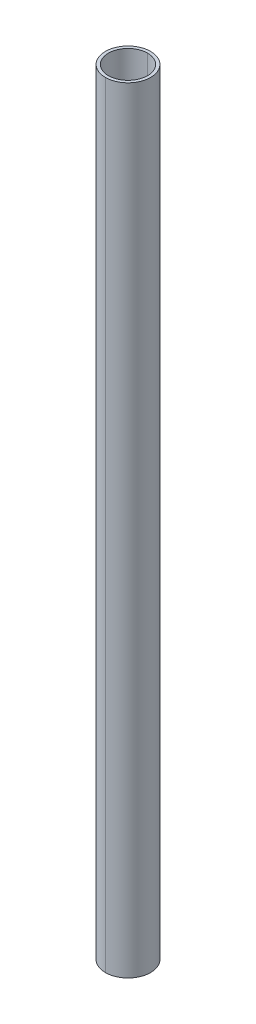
ISO-10303-21;
HEADER;
FILE_DESCRIPTION(('STEP AP214'),'2;1');
FILE_NAME('part.step','',(''),(''),'','','');
FILE_SCHEMA(('AUTOMOTIVE_DESIGN { 1 0 10303 214 1 1 1 1 }'));
ENDSEC;
DATA;
#1=APPLICATION_CONTEXT('core data for automotive mechanical design processes');
#2=APPLICATION_PROTOCOL_DEFINITION('international standard','automotive_design',2000,#1);
#3=PRODUCT_CONTEXT('',#1,'mechanical');
#4=PRODUCT('Part','Part','',(#3));
#5=PRODUCT_RELATED_PRODUCT_CATEGORY('part','',(#4));
#6=PRODUCT_DEFINITION_FORMATION('','',#4);
#7=PRODUCT_DEFINITION_CONTEXT('part definition',#1,'design');
#8=PRODUCT_DEFINITION('design','',#6,#7);
#9=PRODUCT_DEFINITION_SHAPE('','',#8);
#10=(LENGTH_UNIT() NAMED_UNIT(*) SI_UNIT(.MILLI.,.METRE.));
#11=(NAMED_UNIT(*) PLANE_ANGLE_UNIT() SI_UNIT($,.RADIAN.));
#12=(NAMED_UNIT(*) SI_UNIT($,.STERADIAN.) SOLID_ANGLE_UNIT());
#13=UNCERTAINTY_MEASURE_WITH_UNIT(LENGTH_MEASURE(1.E-05),#10,'distance_accuracy_value','');
#14=(GEOMETRIC_REPRESENTATION_CONTEXT(3) GLOBAL_UNCERTAINTY_ASSIGNED_CONTEXT((#13)) GLOBAL_UNIT_ASSIGNED_CONTEXT((#10,
#11,#12)) REPRESENTATION_CONTEXT('',''));
#15=CARTESIAN_POINT('',(0.,0.,0.));
#16=DIRECTION('',(0.,0.,1.));
#17=DIRECTION('',(1.,0.,0.));
#18=AXIS2_PLACEMENT_3D('',#15,#16,#17);
#19=CARTESIAN_POINT('',(0.,515.,0.));
#20=DIRECTION('',(0.,-1.,0.));
#21=DIRECTION('',(0.,0.,-1.));
#22=AXIS2_PLACEMENT_3D('',#19,#20,#21);
#23=CYLINDRICAL_SURFACE('',#22,13.);
#24=DIRECTION('',(0.,-1.,0.));
#25=VECTOR('',#24,1.);
#26=CARTESIAN_POINT('',(0.,515.,13.));
#27=LINE('',#26,#25);
#28=CARTESIAN_POINT('',(0.,515.,13.));
#29=VERTEX_POINT('',#28);
#30=CARTESIAN_POINT('',(0.,0.,13.));
#31=VERTEX_POINT('',#30);
#32=EDGE_CURVE('E123',#29,#31,#27,.T.);
#33=ORIENTED_EDGE('',*,*,#32,.F.);
#34=CARTESIAN_POINT('',(0.,515.,0.));
#35=DIRECTION('',(0.,1.,0.));
#36=DIRECTION('',(0.,0.,1.));
#37=AXIS2_PLACEMENT_3D('',#34,#35,#36);
#38=CIRCLE('',#37,13.);
#39=CARTESIAN_POINT('',(0.,515.,-13.));
#40=VERTEX_POINT('',#39);
#41=EDGE_CURVE('E77',#29,#40,#38,.T.);
#42=ORIENTED_EDGE('',*,*,#41,.T.);
#43=DIRECTION('',(0.,-1.,0.));
#44=VECTOR('',#43,1.);
#45=CARTESIAN_POINT('',(0.,515.,-13.));
#46=LINE('',#45,#44);
#47=CARTESIAN_POINT('',(0.,0.,-13.));
#48=VERTEX_POINT('',#47);
#49=EDGE_CURVE('E87',#40,#48,#46,.T.);
#50=ORIENTED_EDGE('',*,*,#49,.T.);
#51=CARTESIAN_POINT('',(0.,0.,0.));
#52=DIRECTION('',(0.,1.,0.));
#53=DIRECTION('',(0.,0.,1.));
#54=AXIS2_PLACEMENT_3D('',#51,#52,#53);
#55=CIRCLE('',#54,13.);
#56=EDGE_CURVE('E10',#31,#48,#55,.T.);
#57=ORIENTED_EDGE('',*,*,#56,.F.);
#58=EDGE_LOOP('',(#33,#42,#50,#57));
#59=FACE_BOUND('',#58,.T.);
#60=ADVANCED_FACE('F16',(#59),#23,.F.);
#61=CARTESIAN_POINT('',(0.,515.,0.));
#62=DIRECTION('',(0.,-1.,0.));
#63=DIRECTION('',(0.,0.,-1.));
#64=AXIS2_PLACEMENT_3D('',#61,#62,#63);
#65=CYLINDRICAL_SURFACE('',#64,15.);
#66=DIRECTION('',(0.,-1.,0.));
#67=VECTOR('',#66,1.);
#68=CARTESIAN_POINT('',(0.,515.,15.));
#69=LINE('',#68,#67);
#70=CARTESIAN_POINT('',(0.,515.,15.));
#71=VERTEX_POINT('',#70);
#72=CARTESIAN_POINT('',(0.,0.,15.));
#73=VERTEX_POINT('',#72);
#74=EDGE_CURVE('E74',#71,#73,#69,.T.);
#75=ORIENTED_EDGE('',*,*,#74,.F.);
#76=CARTESIAN_POINT('',(0.,515.,0.));
#77=DIRECTION('',(0.,1.,0.));
#78=DIRECTION('',(0.,0.,1.));
#79=AXIS2_PLACEMENT_3D('',#76,#77,#78);
#80=CIRCLE('',#79,15.);
#81=CARTESIAN_POINT('',(0.,515.,-15.));
#82=VERTEX_POINT('',#81);
#83=EDGE_CURVE('E63',#82,#71,#80,.T.);
#84=ORIENTED_EDGE('',*,*,#83,.F.);
#85=DIRECTION('',(0.,-1.,0.));
#86=VECTOR('',#85,1.);
#87=CARTESIAN_POINT('',(0.,515.,-15.));
#88=LINE('',#87,#86);
#89=CARTESIAN_POINT('',(0.,0.,-15.));
#90=VERTEX_POINT('',#89);
#91=EDGE_CURVE('E71',#82,#90,#88,.T.);
#92=ORIENTED_EDGE('',*,*,#91,.T.);
#93=CARTESIAN_POINT('',(0.,0.,0.));
#94=DIRECTION('',(0.,1.,0.));
#95=DIRECTION('',(0.,0.,1.));
#96=AXIS2_PLACEMENT_3D('',#93,#94,#95);
#97=CIRCLE('',#96,15.);
#98=EDGE_CURVE('E19',#90,#73,#97,.T.);
#99=ORIENTED_EDGE('',*,*,#98,.T.);
#100=EDGE_LOOP('',(#75,#84,#92,#99));
#101=FACE_BOUND('',#100,.T.);
#102=ADVANCED_FACE('F70',(#101),#65,.T.);
#103=CARTESIAN_POINT('',(0.,0.,0.));
#104=DIRECTION('',(0.,1.,0.));
#105=DIRECTION('',(1.,0.,0.));
#106=AXIS2_PLACEMENT_3D('',#103,#104,#105);
#107=PLANE('',#106);
#108=CARTESIAN_POINT('',(0.,0.,0.));
#109=DIRECTION('',(0.,1.,0.));
#110=DIRECTION('',(0.,0.,1.));
#111=AXIS2_PLACEMENT_3D('',#108,#109,#110);
#112=CIRCLE('',#111,13.);
#113=EDGE_CURVE('E95',#48,#31,#112,.T.);
#114=ORIENTED_EDGE('',*,*,#113,.T.);
#115=ORIENTED_EDGE('',*,*,#56,.T.);
#116=EDGE_LOOP('',(#114,#115));
#117=FACE_BOUND('',#116,.T.);
#118=ORIENTED_EDGE('',*,*,#98,.F.);
#119=CARTESIAN_POINT('',(0.,0.,0.));
#120=DIRECTION('',(0.,1.,0.));
#121=DIRECTION('',(0.,0.,1.));
#122=AXIS2_PLACEMENT_3D('',#119,#120,#121);
#123=CIRCLE('',#122,15.);
#124=EDGE_CURVE('E82',#73,#90,#123,.T.);
#125=ORIENTED_EDGE('',*,*,#124,.F.);
#126=EDGE_LOOP('',(#118,#125));
#127=FACE_BOUND('',#126,.T.);
#128=ADVANCED_FACE('F107',(#117,#127),#107,.F.);
#129=CARTESIAN_POINT('',(0.,515.,0.));
#130=DIRECTION('',(0.,1.,0.));
#131=DIRECTION('',(1.,0.,0.));
#132=AXIS2_PLACEMENT_3D('',#129,#130,#131);
#133=PLANE('',#132);
#134=CARTESIAN_POINT('',(0.,515.,0.));
#135=DIRECTION('',(0.,1.,0.));
#136=DIRECTION('',(0.,0.,1.));
#137=AXIS2_PLACEMENT_3D('',#134,#135,#136);
#138=CIRCLE('',#137,13.);
#139=EDGE_CURVE('E128',#40,#29,#138,.T.);
#140=ORIENTED_EDGE('',*,*,#139,.F.);
#141=ORIENTED_EDGE('',*,*,#41,.F.);
#142=EDGE_LOOP('',(#140,#141));
#143=FACE_BOUND('',#142,.T.);
#144=ORIENTED_EDGE('',*,*,#83,.T.);
#145=CARTESIAN_POINT('',(0.,515.,0.));
#146=DIRECTION('',(0.,1.,0.));
#147=DIRECTION('',(0.,0.,1.));
#148=AXIS2_PLACEMENT_3D('',#145,#146,#147);
#149=CIRCLE('',#148,15.);
#150=EDGE_CURVE('E81',#71,#82,#149,.T.);
#151=ORIENTED_EDGE('',*,*,#150,.T.);
#152=EDGE_LOOP('',(#144,#151));
#153=FACE_BOUND('',#152,.T.);
#154=ADVANCED_FACE('F85',(#143,#153),#133,.T.);
#155=CARTESIAN_POINT('',(0.,515.,0.));
#156=DIRECTION('',(0.,-1.,0.));
#157=DIRECTION('',(0.,0.,-1.));
#158=AXIS2_PLACEMENT_3D('',#155,#156,#157);
#159=CYLINDRICAL_SURFACE('',#158,15.);
#160=ORIENTED_EDGE('',*,*,#150,.F.);
#161=ORIENTED_EDGE('',*,*,#74,.T.);
#162=ORIENTED_EDGE('',*,*,#124,.T.);
#163=ORIENTED_EDGE('',*,*,#91,.F.);
#164=EDGE_LOOP('',(#160,#161,#162,#163));
#165=FACE_BOUND('',#164,.T.);
#166=ADVANCED_FACE('F80',(#165),#159,.T.);
#167=CARTESIAN_POINT('',(0.,515.,0.));
#168=DIRECTION('',(0.,-1.,0.));
#169=DIRECTION('',(0.,0.,-1.));
#170=AXIS2_PLACEMENT_3D('',#167,#168,#169);
#171=CYLINDRICAL_SURFACE('',#170,13.);
#172=ORIENTED_EDGE('',*,*,#139,.T.);
#173=ORIENTED_EDGE('',*,*,#32,.T.);
#174=ORIENTED_EDGE('',*,*,#113,.F.);
#175=ORIENTED_EDGE('',*,*,#49,.F.);
#176=EDGE_LOOP('',(#172,#173,#174,#175));
#177=FACE_BOUND('',#176,.T.);
#178=ADVANCED_FACE('F131',(#177),#171,.F.);
#179=CLOSED_SHELL('',(#60,#102,#128,#154,#166,#178));
#180=MANIFOLD_SOLID_BREP('B1',#179);
#181=ADVANCED_BREP_SHAPE_REPRESENTATION('',(#18,#180),#14);
#182=SHAPE_DEFINITION_REPRESENTATION(#9,#181);
ENDSEC;
END-ISO-10303-21;
